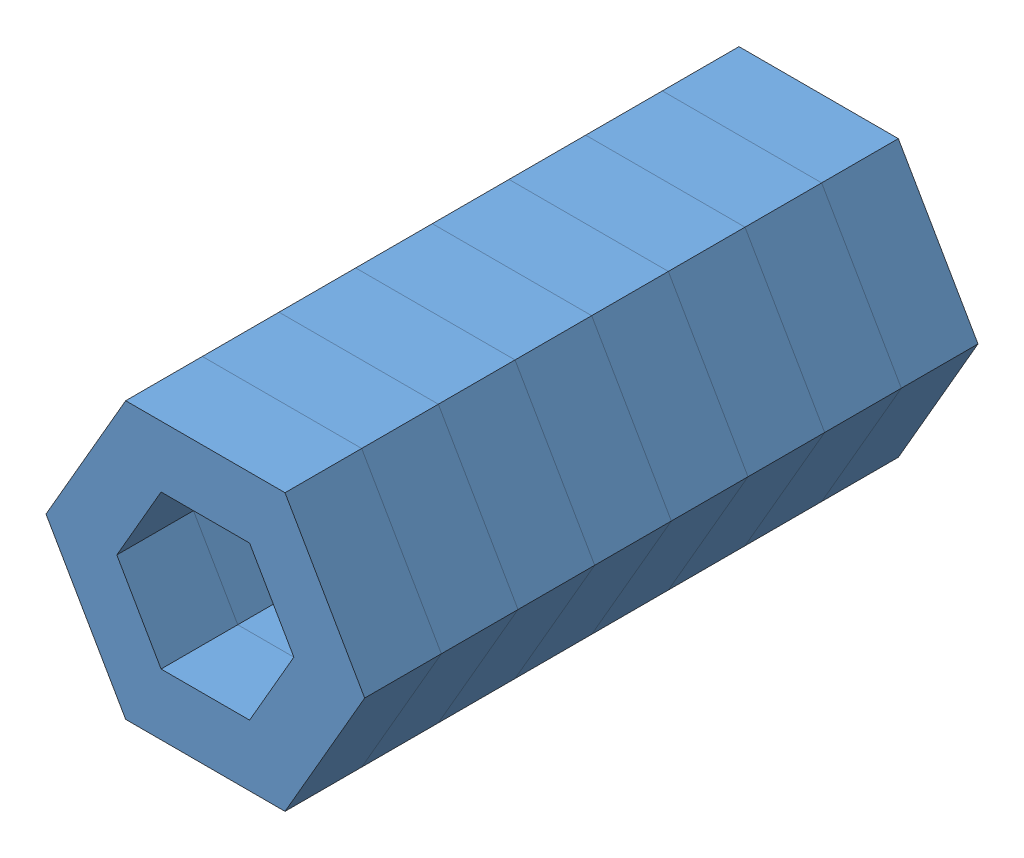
SolidWorks assembly Spacer-stack-8.SLDASM, configuration Default (file format 7000). Lengths in mm.
Overall size (13.2 11.43 25.4).
8 component instances, 1 part files, 14 mates.
Components (placement in the parent):
- Spacer-hex-1s4-1: Spacer-hex-1s4.SLDPRT [Default] at (7.8847 8.4687 7.4956) size (13.2 11.43 3.17)
- Spacer-hex-1s4-2: Spacer-hex-1s4.SLDPRT [Default] at (7.8847 8.4687 10.6706) size (13.2 11.43 3.17)
- Spacer-hex-1s4-3: Spacer-hex-1s4.SLDPRT [Default] at (7.8847 8.4687 13.8456) size (13.2 11.43 3.17)
- Spacer-hex-1s4-4: Spacer-hex-1s4.SLDPRT [Default] at (7.8847 8.4687 17.0206) size (13.2 11.43 3.17)
- Spacer-hex-1s4-5: Spacer-hex-1s4.SLDPRT [Default] at (7.8847 8.4687 20.1956) size (13.2 11.43 3.17)
- Spacer-hex-1s4-6: Spacer-hex-1s4.SLDPRT [Default] at (7.8847 8.4687 23.3706) size (13.2 11.43 3.17)
- Spacer-hex-1s4-7: Spacer-hex-1s4.SLDPRT [Default] at (7.8847 8.4687 26.5456) size (13.2 11.43 3.17)
- Spacer-hex-1s4-8: Spacer-hex-1s4.SLDPRT [Default] at (7.8847 8.4687 29.7206) size (13.2 11.43 3.17)
Mates (geometry in assembly coordinates):
- Coincident3: coincident aligned: line of Spacer-hex-1s4-1 through (9.7178 11.6437 10.6706) axis (-1 0 0); line of Spacer-hex-1s4-2 through (9.7178 11.6437 10.6706) axis (-1 0 0)
- Coincident4: coincident aligned: line of Spacer-hex-1s4-1 through (11.5509 8.4687 10.6706) axis (-0.5 0.866025 0); line of Spacer-hex-1s4-2 through (11.5509 8.4687 10.6706) axis (-0.5 0.866025 0)
- Coincident5: coincident aligned: line of Spacer-hex-1s4-2 through (9.7178 11.6437 13.8456) axis (-1 0 0); line of Spacer-hex-1s4-3 through (9.7178 11.6437 13.8456) axis (-1 0 0)
- Coincident6: coincident aligned: line of Spacer-hex-1s4-2 through (11.5509 8.4687 13.8456) axis (-0.5 0.866025 0); line of Spacer-hex-1s4-3 through (11.5509 8.4687 13.8456) axis (-0.5 0.866025 0)
- Coincident9: coincident aligned: line of Spacer-hex-1s4-3 through (11.5509 8.4687 17.0206) axis (-0.5 0.866025 0); line of Spacer-hex-1s4-4 through (11.5509 8.4687 17.0206) axis (-0.5 0.866025 0)
- Coincident10: coincident aligned: line of Spacer-hex-1s4-3 through (9.7178 11.6437 17.0206) axis (-1 0 0); line of Spacer-hex-1s4-4 through (9.7178 11.6437 17.0206) axis (-1 0 0)
- Coincident11: coincident aligned: line of Spacer-hex-1s4-4 through (9.7178 11.6437 20.1956) axis (-1 0 0); line of Spacer-hex-1s4-5 through (9.7178 11.6437 20.1956) axis (-1 0 0)
- Coincident12: coincident aligned: line of Spacer-hex-1s4-4 through (11.5509 8.4687 20.1956) axis (-0.5 0.866025 0); line of Spacer-hex-1s4-5 through (11.5509 8.4687 20.1956) axis (-0.5 0.866025 0)
- Coincident13: coincident aligned: line of Spacer-hex-1s4-5 through (9.7178 11.6437 23.3706) axis (-1 0 0); line of Spacer-hex-1s4-6 through (9.7178 11.6437 23.3706) axis (-1 0 0)
- Coincident14: coincident aligned: line of Spacer-hex-1s4-5 through (11.5509 8.4687 23.3706) axis (-0.5 0.866025 0); line of Spacer-hex-1s4-6 through (11.5509 8.4687 23.3706) axis (-0.5 0.866025 0)
- Coincident15: coincident aligned: line of Spacer-hex-1s4-6 through (9.7178 11.6437 26.5456) axis (-1 0 0); line of Spacer-hex-1s4-7 through (9.7178 11.6437 26.5456) axis (-1 0 0)
- Coincident16: coincident aligned: line of Spacer-hex-1s4-6 through (11.5509 8.4687 26.5456) axis (-0.5 0.866025 0); line of Spacer-hex-1s4-7 through (11.5509 8.4687 26.5456) axis (-0.5 0.866025 0)
- Coincident17: coincident aligned: line of Spacer-hex-1s4-7 through (9.7178 11.6437 29.7206) axis (-1 0 0); line of Spacer-hex-1s4-8 through (9.7178 11.6437 29.7206) axis (-1 0 0)
- Coincident18: coincident aligned: line of Spacer-hex-1s4-7 through (11.5509 8.4687 29.7206) axis (-0.5 0.866025 0); line of Spacer-hex-1s4-8 through (11.5509 8.4687 29.7206) axis (-0.5 0.866025 0)
